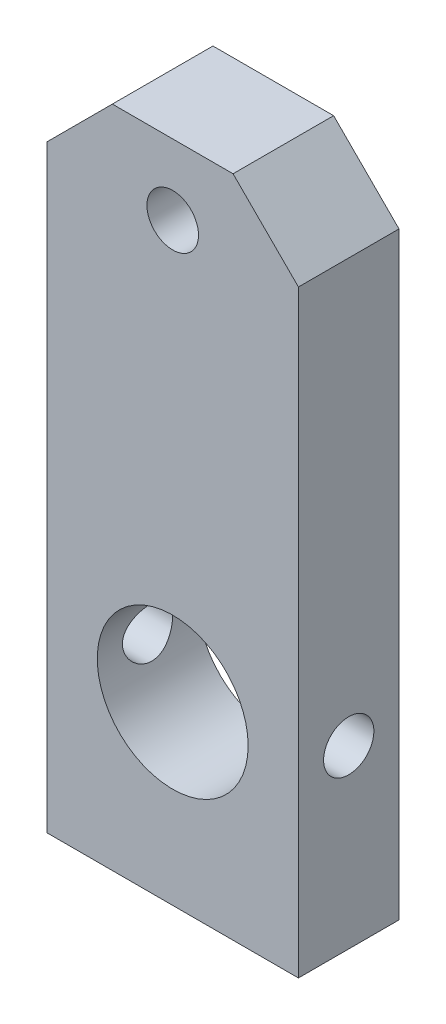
from build123d import *

# Parameters (mm, degrees)
ESQUISSE1_R             = 15
ESQUISSE1_R_2           = 5.125
BASE_EXTRUSION_DEPTH    = 10
ESQUISSE2_R             = 5
ENL_V_MAT_EXTRU_1_DEPTH = 142.50618361


with BuildPart() as part:
    # Esquisse1 → Base-Extrusion (new, symmetric)
    with BuildSketch(Plane.XY):
        Polygon((12, 132), (25, 119), (25, 0), (-25, 0), (-25, 119), (-12, 132), align=None)
        with Locations((0, 35)):
            Circle(ESQUISSE1_R, mode=Mode.SUBTRACT)
        with Locations((0, 118)):
            Circle(ESQUISSE1_R_2, mode=Mode.SUBTRACT)
    extrude(amount=BASE_EXTRUSION_DEPTH, both=True)

    # Esquisse2 → Enl_v. mat.-Extru.1 (cut, through all)
    with BuildSketch(Plane(origin=(25, 0, 0), x_dir=(0, 0, -1), z_dir=(1, 0, 0))):
        with Locations(Location((0, 35, 0), (0, 0, 90))):
            Circle(ESQUISSE2_R)
    extrude(amount=-ENL_V_MAT_EXTRU_1_DEPTH, mode=Mode.SUBTRACT)


solid = part.part
